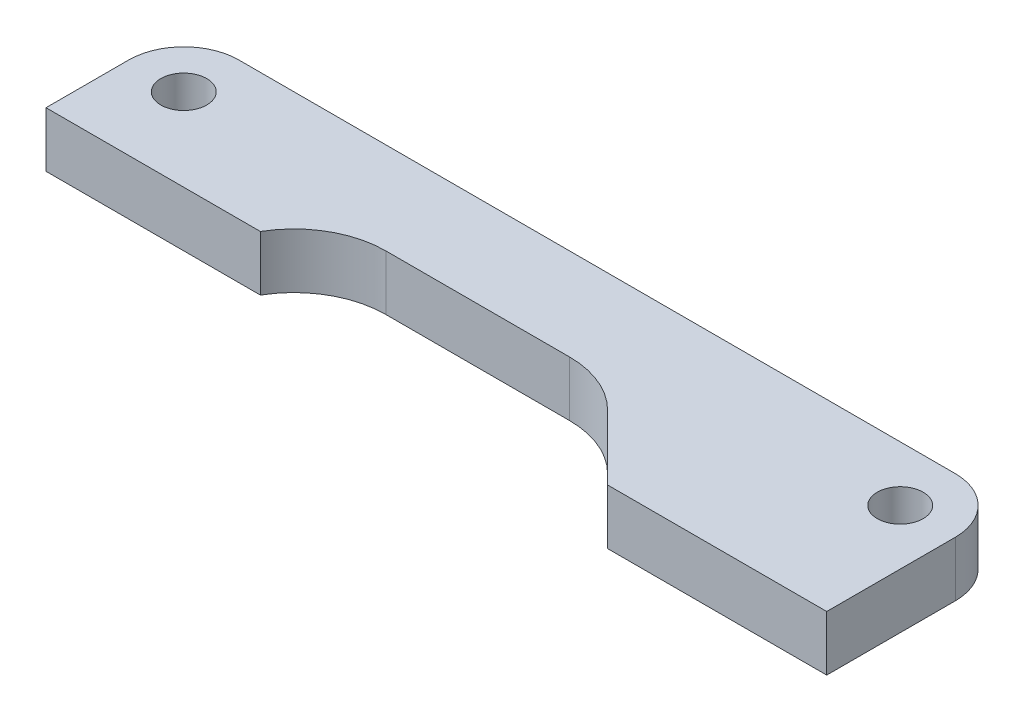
ISO-10303-21;
HEADER;
FILE_DESCRIPTION(('STEP AP214'),'2;1');
FILE_NAME('part.step','',(''),(''),'','','');
FILE_SCHEMA(('AUTOMOTIVE_DESIGN { 1 0 10303 214 1 1 1 1 }'));
ENDSEC;
DATA;
#1=APPLICATION_CONTEXT('core data for automotive mechanical design processes');
#2=APPLICATION_PROTOCOL_DEFINITION('international standard','automotive_design',2000,#1);
#3=PRODUCT_CONTEXT('',#1,'mechanical');
#4=PRODUCT('Part','Part','',(#3));
#5=PRODUCT_RELATED_PRODUCT_CATEGORY('part','',(#4));
#6=PRODUCT_DEFINITION_FORMATION('','',#4);
#7=PRODUCT_DEFINITION_CONTEXT('part definition',#1,'design');
#8=PRODUCT_DEFINITION('design','',#6,#7);
#9=PRODUCT_DEFINITION_SHAPE('','',#8);
#10=(LENGTH_UNIT() NAMED_UNIT(*) SI_UNIT(.MILLI.,.METRE.));
#11=(NAMED_UNIT(*) PLANE_ANGLE_UNIT() SI_UNIT($,.RADIAN.));
#12=(NAMED_UNIT(*) SI_UNIT($,.STERADIAN.) SOLID_ANGLE_UNIT());
#13=UNCERTAINTY_MEASURE_WITH_UNIT(LENGTH_MEASURE(1.E-05),#10,'distance_accuracy_value','');
#14=(GEOMETRIC_REPRESENTATION_CONTEXT(3) GLOBAL_UNCERTAINTY_ASSIGNED_CONTEXT((#13)) GLOBAL_UNIT_ASSIGNED_CONTEXT((#10,
#11,#12)) REPRESENTATION_CONTEXT('',''));
#15=CARTESIAN_POINT('',(0.,0.,0.));
#16=DIRECTION('',(0.,0.,1.));
#17=DIRECTION('',(1.,0.,0.));
#18=AXIS2_PLACEMENT_3D('',#15,#16,#17);
#19=CARTESIAN_POINT('',(6.,6.,-14.));
#20=DIRECTION('',(0.,-1.,0.));
#21=DIRECTION('',(0.,0.,-1.));
#22=AXIS2_PLACEMENT_3D('',#19,#20,#21);
#23=PLANE('',#22);
#24=CARTESIAN_POINT('',(6.,6.,-14.));
#25=DIRECTION('',(0.,1.,0.));
#26=DIRECTION('',(0.,0.,1.));
#27=AXIS2_PLACEMENT_3D('',#24,#25,#26);
#28=CIRCLE('',#27,2.5);
#29=CARTESIAN_POINT('',(6.,6.,-11.5));
#30=VERTEX_POINT('',#29);
#31=EDGE_CURVE('E132',#30,#30,#28,.T.);
#32=ORIENTED_EDGE('',*,*,#31,.F.);
#33=EDGE_LOOP('',(#32));
#34=FACE_BOUND('',#33,.T.);
#35=CARTESIAN_POINT('',(6.,6.,-14.));
#36=DIRECTION('',(0.,1.,0.));
#37=DIRECTION('',(0.,0.,-1.));
#38=AXIS2_PLACEMENT_3D('',#35,#36,#37);
#39=CIRCLE('',#38,6.);
#40=CARTESIAN_POINT('',(6.00000000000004,6.,-20.));
#41=VERTEX_POINT('',#40);
#42=CARTESIAN_POINT('',(0.,6.,-14.));
#43=VERTEX_POINT('',#42);
#44=EDGE_CURVE('E156',#41,#43,#39,.T.);
#45=ORIENTED_EDGE('',*,*,#44,.T.);
#46=DIRECTION('',(0.,0.,1.));
#47=VECTOR('',#46,1.);
#48=CARTESIAN_POINT('',(0.,6.,-5.));
#49=LINE('',#48,#47);
#50=CARTESIAN_POINT('',(0.,6.,-5.));
#51=VERTEX_POINT('',#50);
#52=EDGE_CURVE('E127',#43,#51,#49,.T.);
#53=ORIENTED_EDGE('',*,*,#52,.T.);
#54=DIRECTION('',(1.,0.,0.));
#55=VECTOR('',#54,1.);
#56=CARTESIAN_POINT('',(0.,6.,-5.));
#57=LINE('',#56,#55);
#58=CARTESIAN_POINT('',(23.3397459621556,6.,-5.));
#59=VERTEX_POINT('',#58);
#60=EDGE_CURVE('E159',#51,#59,#57,.T.);
#61=ORIENTED_EDGE('',*,*,#60,.T.);
#62=CARTESIAN_POINT('',(32.,6.,0.));
#63=DIRECTION('',(0.,-1.,0.));
#64=DIRECTION('',(0.,0.,1.));
#65=AXIS2_PLACEMENT_3D('',#62,#63,#64);
#66=CIRCLE('',#65,10.);
#67=CARTESIAN_POINT('',(32.,6.,-10.));
#68=VERTEX_POINT('',#67);
#69=EDGE_CURVE('E161',#59,#68,#66,.T.);
#70=ORIENTED_EDGE('',*,*,#69,.T.);
#71=DIRECTION('',(1.,0.,0.));
#72=VECTOR('',#71,1.);
#73=CARTESIAN_POINT('',(32.,6.,-10.));
#74=LINE('',#73,#72);
#75=CARTESIAN_POINT('',(52.,6.,-10.));
#76=VERTEX_POINT('',#75);
#77=EDGE_CURVE('E163',#68,#76,#74,.T.);
#78=ORIENTED_EDGE('',*,*,#77,.T.);
#79=CARTESIAN_POINT('',(52.,6.,0.));
#80=DIRECTION('',(0.,-1.,0.));
#81=DIRECTION('',(0.,0.,1.));
#82=AXIS2_PLACEMENT_3D('',#79,#80,#81);
#83=CIRCLE('',#82,10.);
#84=CARTESIAN_POINT('',(59.0710678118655,6.,-7.07106781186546));
#85=VERTEX_POINT('',#84);
#86=EDGE_CURVE('E165',#76,#85,#83,.T.);
#87=ORIENTED_EDGE('',*,*,#86,.T.);
#88=DIRECTION('',(0.707106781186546,0.,0.707106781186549));
#89=VECTOR('',#88,1.);
#90=CARTESIAN_POINT('',(59.0710678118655,6.,-7.07106781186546));
#91=LINE('',#90,#89);
#92=CARTESIAN_POINT('',(66.1421356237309,6.,0.));
#93=VERTEX_POINT('',#92);
#94=EDGE_CURVE('E167',#85,#93,#91,.T.);
#95=ORIENTED_EDGE('',*,*,#94,.T.);
#96=DIRECTION('',(1.,0.,0.));
#97=VECTOR('',#96,1.);
#98=CARTESIAN_POINT('',(66.1421356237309,6.,0.));
#99=LINE('',#98,#97);
#100=CARTESIAN_POINT('',(90.,6.,0.));
#101=VERTEX_POINT('',#100);
#102=EDGE_CURVE('E169',#93,#101,#99,.T.);
#103=ORIENTED_EDGE('',*,*,#102,.T.);
#104=DIRECTION('',(0.,0.,-1.));
#105=VECTOR('',#104,1.);
#106=CARTESIAN_POINT('',(90.,6.,0.));
#107=LINE('',#106,#105);
#108=CARTESIAN_POINT('',(90.,6.,-14.));
#109=VERTEX_POINT('',#108);
#110=EDGE_CURVE('E171',#101,#109,#107,.T.);
#111=ORIENTED_EDGE('',*,*,#110,.T.);
#112=CARTESIAN_POINT('',(84.,6.,-14.));
#113=DIRECTION('',(0.,1.,0.));
#114=DIRECTION('',(0.,0.,1.));
#115=AXIS2_PLACEMENT_3D('',#112,#113,#114);
#116=CIRCLE('',#115,6.);
#117=CARTESIAN_POINT('',(83.9999999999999,6.,-20.));
#118=VERTEX_POINT('',#117);
#119=EDGE_CURVE('E50',#109,#118,#116,.T.);
#120=ORIENTED_EDGE('',*,*,#119,.T.);
#121=DIRECTION('',(-1.,0.,0.));
#122=VECTOR('',#121,1.);
#123=CARTESIAN_POINT('',(6.00000000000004,6.,-20.));
#124=LINE('',#123,#122);
#125=EDGE_CURVE('E45',#118,#41,#124,.T.);
#126=ORIENTED_EDGE('',*,*,#125,.T.);
#127=EDGE_LOOP('',(#45,#53,#61,#70,#78,#87,#95,#103,#111,#120,#126));
#128=FACE_BOUND('',#127,.T.);
#129=CARTESIAN_POINT('',(84.,6.,-14.));
#130=DIRECTION('',(0.,1.,0.));
#131=DIRECTION('',(0.,0.,1.));
#132=AXIS2_PLACEMENT_3D('',#129,#130,#131);
#133=CIRCLE('',#132,2.5);
#134=CARTESIAN_POINT('',(84.,6.,-11.5));
#135=VERTEX_POINT('',#134);
#136=EDGE_CURVE('E266',#135,#135,#133,.T.);
#137=ORIENTED_EDGE('',*,*,#136,.F.);
#138=EDGE_LOOP('',(#137));
#139=FACE_BOUND('',#138,.T.);
#140=ADVANCED_FACE('F30',(#34,#128,#139),#23,.F.);
#141=CARTESIAN_POINT('',(6.,0.,-14.));
#142=DIRECTION('',(0.,-1.,0.));
#143=DIRECTION('',(0.,0.,-1.));
#144=AXIS2_PLACEMENT_3D('',#141,#142,#143);
#145=PLANE('',#144);
#146=CARTESIAN_POINT('',(6.,0.,-14.));
#147=DIRECTION('',(0.,1.,0.));
#148=DIRECTION('',(0.,0.,1.));
#149=AXIS2_PLACEMENT_3D('',#146,#147,#148);
#150=CIRCLE('',#149,2.5);
#151=CARTESIAN_POINT('',(6.,0.,-11.5));
#152=VERTEX_POINT('',#151);
#153=EDGE_CURVE('E135',#152,#152,#150,.T.);
#154=ORIENTED_EDGE('',*,*,#153,.T.);
#155=EDGE_LOOP('',(#154));
#156=FACE_BOUND('',#155,.T.);
#157=CARTESIAN_POINT('',(6.,0.,-14.));
#158=DIRECTION('',(0.,1.,0.));
#159=DIRECTION('',(0.,0.,-1.));
#160=AXIS2_PLACEMENT_3D('',#157,#158,#159);
#161=CIRCLE('',#160,6.);
#162=CARTESIAN_POINT('',(6.00000000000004,0.,-20.));
#163=VERTEX_POINT('',#162);
#164=CARTESIAN_POINT('',(0.,0.,-14.));
#165=VERTEX_POINT('',#164);
#166=EDGE_CURVE('E118',#163,#165,#161,.T.);
#167=ORIENTED_EDGE('',*,*,#166,.F.);
#168=DIRECTION('',(-1.,0.,0.));
#169=VECTOR('',#168,1.);
#170=CARTESIAN_POINT('',(6.00000000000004,0.,-20.));
#171=LINE('',#170,#169);
#172=CARTESIAN_POINT('',(83.9999999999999,0.,-20.));
#173=VERTEX_POINT('',#172);
#174=EDGE_CURVE('E154',#173,#163,#171,.T.);
#175=ORIENTED_EDGE('',*,*,#174,.F.);
#176=CARTESIAN_POINT('',(84.,0.,-14.));
#177=DIRECTION('',(0.,1.,0.));
#178=DIRECTION('',(0.,0.,1.));
#179=AXIS2_PLACEMENT_3D('',#176,#177,#178);
#180=CIRCLE('',#179,6.);
#181=CARTESIAN_POINT('',(90.,0.,-14.));
#182=VERTEX_POINT('',#181);
#183=EDGE_CURVE('E152',#182,#173,#180,.T.);
#184=ORIENTED_EDGE('',*,*,#183,.F.);
#185=DIRECTION('',(0.,0.,-1.));
#186=VECTOR('',#185,1.);
#187=CARTESIAN_POINT('',(90.,0.,0.));
#188=LINE('',#187,#186);
#189=CARTESIAN_POINT('',(90.,0.,0.));
#190=VERTEX_POINT('',#189);
#191=EDGE_CURVE('E150',#190,#182,#188,.T.);
#192=ORIENTED_EDGE('',*,*,#191,.F.);
#193=DIRECTION('',(1.,0.,0.));
#194=VECTOR('',#193,1.);
#195=CARTESIAN_POINT('',(66.1421356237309,0.,0.));
#196=LINE('',#195,#194);
#197=CARTESIAN_POINT('',(66.1421356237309,0.,0.));
#198=VERTEX_POINT('',#197);
#199=EDGE_CURVE('E148',#198,#190,#196,.T.);
#200=ORIENTED_EDGE('',*,*,#199,.F.);
#201=DIRECTION('',(0.707106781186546,0.,0.707106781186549));
#202=VECTOR('',#201,1.);
#203=CARTESIAN_POINT('',(59.0710678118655,0.,-7.07106781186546));
#204=LINE('',#203,#202);
#205=CARTESIAN_POINT('',(59.0710678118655,0.,-7.07106781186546));
#206=VERTEX_POINT('',#205);
#207=EDGE_CURVE('E146',#206,#198,#204,.T.);
#208=ORIENTED_EDGE('',*,*,#207,.F.);
#209=CARTESIAN_POINT('',(52.,0.,0.));
#210=DIRECTION('',(0.,-1.,0.));
#211=DIRECTION('',(0.,0.,1.));
#212=AXIS2_PLACEMENT_3D('',#209,#210,#211);
#213=CIRCLE('',#212,10.);
#214=CARTESIAN_POINT('',(52.,0.,-10.));
#215=VERTEX_POINT('',#214);
#216=EDGE_CURVE('E144',#215,#206,#213,.T.);
#217=ORIENTED_EDGE('',*,*,#216,.F.);
#218=DIRECTION('',(1.,0.,0.));
#219=VECTOR('',#218,1.);
#220=CARTESIAN_POINT('',(32.,0.,-10.));
#221=LINE('',#220,#219);
#222=CARTESIAN_POINT('',(32.,0.,-10.));
#223=VERTEX_POINT('',#222);
#224=EDGE_CURVE('E142',#223,#215,#221,.T.);
#225=ORIENTED_EDGE('',*,*,#224,.F.);
#226=CARTESIAN_POINT('',(32.,0.,0.));
#227=DIRECTION('',(0.,-1.,0.));
#228=DIRECTION('',(0.,0.,1.));
#229=AXIS2_PLACEMENT_3D('',#226,#227,#228);
#230=CIRCLE('',#229,10.);
#231=CARTESIAN_POINT('',(23.3397459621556,0.,-5.));
#232=VERTEX_POINT('',#231);
#233=EDGE_CURVE('E140',#232,#223,#230,.T.);
#234=ORIENTED_EDGE('',*,*,#233,.F.);
#235=DIRECTION('',(1.,0.,0.));
#236=VECTOR('',#235,1.);
#237=CARTESIAN_POINT('',(0.,0.,-5.));
#238=LINE('',#237,#236);
#239=CARTESIAN_POINT('',(0.,0.,-5.));
#240=VERTEX_POINT('',#239);
#241=EDGE_CURVE('E120',#240,#232,#238,.T.);
#242=ORIENTED_EDGE('',*,*,#241,.F.);
#243=DIRECTION('',(0.,0.,1.));
#244=VECTOR('',#243,1.);
#245=CARTESIAN_POINT('',(0.,0.,-5.));
#246=LINE('',#245,#244);
#247=EDGE_CURVE('E113',#165,#240,#246,.T.);
#248=ORIENTED_EDGE('',*,*,#247,.F.);
#249=EDGE_LOOP('',(#167,#175,#184,#192,#200,#208,#217,#225,#234,#242,#248));
#250=FACE_BOUND('',#249,.T.);
#251=CARTESIAN_POINT('',(84.,0.,-14.));
#252=DIRECTION('',(0.,1.,0.));
#253=DIRECTION('',(0.,0.,1.));
#254=AXIS2_PLACEMENT_3D('',#251,#252,#253);
#255=CIRCLE('',#254,2.5);
#256=CARTESIAN_POINT('',(84.,0.,-11.5));
#257=VERTEX_POINT('',#256);
#258=EDGE_CURVE('E269',#257,#257,#255,.T.);
#259=ORIENTED_EDGE('',*,*,#258,.T.);
#260=EDGE_LOOP('',(#259));
#261=FACE_BOUND('',#260,.T.);
#262=ADVANCED_FACE('F114',(#156,#250,#261),#145,.T.);
#263=CARTESIAN_POINT('',(6.,6.,-14.));
#264=DIRECTION('',(0.,-1.,0.));
#265=DIRECTION('',(0.,0.,-1.));
#266=AXIS2_PLACEMENT_3D('',#263,#264,#265);
#267=CYLINDRICAL_SURFACE('',#266,6.);
#268=ORIENTED_EDGE('',*,*,#166,.T.);
#269=DIRECTION('',(0.,-1.,0.));
#270=VECTOR('',#269,1.);
#271=CARTESIAN_POINT('',(0.,6.,-14.));
#272=LINE('',#271,#270);
#273=EDGE_CURVE('E11',#43,#165,#272,.T.);
#274=ORIENTED_EDGE('',*,*,#273,.F.);
#275=ORIENTED_EDGE('',*,*,#44,.F.);
#276=DIRECTION('',(0.,-1.,0.));
#277=VECTOR('',#276,1.);
#278=CARTESIAN_POINT('',(6.00000000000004,6.,-20.));
#279=LINE('',#278,#277);
#280=EDGE_CURVE('E131',#41,#163,#279,.T.);
#281=ORIENTED_EDGE('',*,*,#280,.T.);
#282=EDGE_LOOP('',(#268,#274,#275,#281));
#283=FACE_BOUND('',#282,.T.);
#284=ADVANCED_FACE('F32',(#283),#267,.T.);
#285=CARTESIAN_POINT('',(0.,6.,-5.));
#286=DIRECTION('',(1.,0.,0.));
#287=DIRECTION('',(0.,0.,-1.));
#288=AXIS2_PLACEMENT_3D('',#285,#286,#287);
#289=PLANE('',#288);
#290=ORIENTED_EDGE('',*,*,#247,.T.);
#291=DIRECTION('',(0.,-1.,0.));
#292=VECTOR('',#291,1.);
#293=CARTESIAN_POINT('',(0.,6.,-5.));
#294=LINE('',#293,#292);
#295=EDGE_CURVE('E38',#51,#240,#294,.T.);
#296=ORIENTED_EDGE('',*,*,#295,.F.);
#297=ORIENTED_EDGE('',*,*,#52,.F.);
#298=ORIENTED_EDGE('',*,*,#273,.T.);
#299=EDGE_LOOP('',(#290,#296,#297,#298));
#300=FACE_BOUND('',#299,.T.);
#301=ADVANCED_FACE('F126',(#300),#289,.F.);
#302=CARTESIAN_POINT('',(0.,6.,-5.));
#303=DIRECTION('',(0.,0.,-1.));
#304=DIRECTION('',(-1.,0.,0.));
#305=AXIS2_PLACEMENT_3D('',#302,#303,#304);
#306=PLANE('',#305);
#307=ORIENTED_EDGE('',*,*,#241,.T.);
#308=DIRECTION('',(0.,-1.,0.));
#309=VECTOR('',#308,1.);
#310=CARTESIAN_POINT('',(23.3397459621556,6.,-5.));
#311=LINE('',#310,#309);
#312=EDGE_CURVE('E197',#59,#232,#311,.T.);
#313=ORIENTED_EDGE('',*,*,#312,.F.);
#314=ORIENTED_EDGE('',*,*,#60,.F.);
#315=ORIENTED_EDGE('',*,*,#295,.T.);
#316=EDGE_LOOP('',(#307,#313,#314,#315));
#317=FACE_BOUND('',#316,.T.);
#318=ADVANCED_FACE('F201',(#317),#306,.F.);
#319=CARTESIAN_POINT('',(32.,6.,0.));
#320=DIRECTION('',(0.,-1.,0.));
#321=DIRECTION('',(0.,0.,-1.));
#322=AXIS2_PLACEMENT_3D('',#319,#320,#321);
#323=CYLINDRICAL_SURFACE('',#322,10.);
#324=ORIENTED_EDGE('',*,*,#233,.T.);
#325=DIRECTION('',(0.,-1.,0.));
#326=VECTOR('',#325,1.);
#327=CARTESIAN_POINT('',(32.,6.,-10.));
#328=LINE('',#327,#326);
#329=EDGE_CURVE('E194',#68,#223,#328,.T.);
#330=ORIENTED_EDGE('',*,*,#329,.F.);
#331=ORIENTED_EDGE('',*,*,#69,.F.);
#332=ORIENTED_EDGE('',*,*,#312,.T.);
#333=EDGE_LOOP('',(#324,#330,#331,#332));
#334=FACE_BOUND('',#333,.T.);
#335=ADVANCED_FACE('F209',(#334),#323,.F.);
#336=CARTESIAN_POINT('',(32.,6.,-10.));
#337=DIRECTION('',(0.,0.,-1.));
#338=DIRECTION('',(-1.,0.,0.));
#339=AXIS2_PLACEMENT_3D('',#336,#337,#338);
#340=PLANE('',#339);
#341=ORIENTED_EDGE('',*,*,#224,.T.);
#342=DIRECTION('',(0.,-1.,0.));
#343=VECTOR('',#342,1.);
#344=CARTESIAN_POINT('',(52.,6.,-10.));
#345=LINE('',#344,#343);
#346=EDGE_CURVE('E191',#76,#215,#345,.T.);
#347=ORIENTED_EDGE('',*,*,#346,.F.);
#348=ORIENTED_EDGE('',*,*,#77,.F.);
#349=ORIENTED_EDGE('',*,*,#329,.T.);
#350=EDGE_LOOP('',(#341,#347,#348,#349));
#351=FACE_BOUND('',#350,.T.);
#352=ADVANCED_FACE('F212',(#351),#340,.F.);
#353=CARTESIAN_POINT('',(52.,6.,0.));
#354=DIRECTION('',(0.,-1.,0.));
#355=DIRECTION('',(0.,0.,-1.));
#356=AXIS2_PLACEMENT_3D('',#353,#354,#355);
#357=CYLINDRICAL_SURFACE('',#356,10.);
#358=ORIENTED_EDGE('',*,*,#216,.T.);
#359=DIRECTION('',(0.,-1.,0.));
#360=VECTOR('',#359,1.);
#361=CARTESIAN_POINT('',(59.0710678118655,6.,-7.07106781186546));
#362=LINE('',#361,#360);
#363=EDGE_CURVE('E188',#85,#206,#362,.T.);
#364=ORIENTED_EDGE('',*,*,#363,.F.);
#365=ORIENTED_EDGE('',*,*,#86,.F.);
#366=ORIENTED_EDGE('',*,*,#346,.T.);
#367=EDGE_LOOP('',(#358,#364,#365,#366));
#368=FACE_BOUND('',#367,.T.);
#369=ADVANCED_FACE('F217',(#368),#357,.F.);
#370=CARTESIAN_POINT('',(59.0710678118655,6.,-7.07106781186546));
#371=DIRECTION('',(0.707106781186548,0.,-0.707106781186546));
#372=DIRECTION('',(-0.707106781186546,0.,-0.707106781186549));
#373=AXIS2_PLACEMENT_3D('',#370,#371,#372);
#374=PLANE('',#373);
#375=ORIENTED_EDGE('',*,*,#207,.T.);
#376=DIRECTION('',(0.,-1.,0.));
#377=VECTOR('',#376,1.);
#378=CARTESIAN_POINT('',(66.1421356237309,6.,0.));
#379=LINE('',#378,#377);
#380=EDGE_CURVE('E185',#93,#198,#379,.T.);
#381=ORIENTED_EDGE('',*,*,#380,.F.);
#382=ORIENTED_EDGE('',*,*,#94,.F.);
#383=ORIENTED_EDGE('',*,*,#363,.T.);
#384=EDGE_LOOP('',(#375,#381,#382,#383));
#385=FACE_BOUND('',#384,.T.);
#386=ADVANCED_FACE('F223',(#385),#374,.F.);
#387=CARTESIAN_POINT('',(66.1421356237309,6.,0.));
#388=DIRECTION('',(0.,0.,-1.));
#389=DIRECTION('',(-1.,0.,0.));
#390=AXIS2_PLACEMENT_3D('',#387,#388,#389);
#391=PLANE('',#390);
#392=ORIENTED_EDGE('',*,*,#199,.T.);
#393=DIRECTION('',(0.,-1.,0.));
#394=VECTOR('',#393,1.);
#395=CARTESIAN_POINT('',(90.,6.,0.));
#396=LINE('',#395,#394);
#397=EDGE_CURVE('E182',#101,#190,#396,.T.);
#398=ORIENTED_EDGE('',*,*,#397,.F.);
#399=ORIENTED_EDGE('',*,*,#102,.F.);
#400=ORIENTED_EDGE('',*,*,#380,.T.);
#401=EDGE_LOOP('',(#392,#398,#399,#400));
#402=FACE_BOUND('',#401,.T.);
#403=ADVANCED_FACE('F227',(#402),#391,.F.);
#404=CARTESIAN_POINT('',(90.,6.,0.));
#405=DIRECTION('',(-1.,0.,0.));
#406=DIRECTION('',(0.,0.,1.));
#407=AXIS2_PLACEMENT_3D('',#404,#405,#406);
#408=PLANE('',#407);
#409=ORIENTED_EDGE('',*,*,#191,.T.);
#410=DIRECTION('',(0.,-1.,0.));
#411=VECTOR('',#410,1.);
#412=CARTESIAN_POINT('',(90.,6.,-14.));
#413=LINE('',#412,#411);
#414=EDGE_CURVE('E179',#109,#182,#413,.T.);
#415=ORIENTED_EDGE('',*,*,#414,.F.);
#416=ORIENTED_EDGE('',*,*,#110,.F.);
#417=ORIENTED_EDGE('',*,*,#397,.T.);
#418=EDGE_LOOP('',(#409,#415,#416,#417));
#419=FACE_BOUND('',#418,.T.);
#420=ADVANCED_FACE('F232',(#419),#408,.F.);
#421=CARTESIAN_POINT('',(84.,6.,-14.));
#422=DIRECTION('',(0.,-1.,0.));
#423=DIRECTION('',(0.,0.,-1.));
#424=AXIS2_PLACEMENT_3D('',#421,#422,#423);
#425=CYLINDRICAL_SURFACE('',#424,6.);
#426=ORIENTED_EDGE('',*,*,#183,.T.);
#427=DIRECTION('',(0.,-1.,0.));
#428=VECTOR('',#427,1.);
#429=CARTESIAN_POINT('',(83.9999999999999,6.,-20.));
#430=LINE('',#429,#428);
#431=EDGE_CURVE('E176',#118,#173,#430,.T.);
#432=ORIENTED_EDGE('',*,*,#431,.F.);
#433=ORIENTED_EDGE('',*,*,#119,.F.);
#434=ORIENTED_EDGE('',*,*,#414,.T.);
#435=EDGE_LOOP('',(#426,#432,#433,#434));
#436=FACE_BOUND('',#435,.T.);
#437=ADVANCED_FACE('F235',(#436),#425,.T.);
#438=CARTESIAN_POINT('',(6.00000000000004,6.,-20.));
#439=DIRECTION('',(0.,0.,1.));
#440=DIRECTION('',(1.,0.,0.));
#441=AXIS2_PLACEMENT_3D('',#438,#439,#440);
#442=PLANE('',#441);
#443=ORIENTED_EDGE('',*,*,#174,.T.);
#444=ORIENTED_EDGE('',*,*,#280,.F.);
#445=ORIENTED_EDGE('',*,*,#125,.F.);
#446=ORIENTED_EDGE('',*,*,#431,.T.);
#447=EDGE_LOOP('',(#443,#444,#445,#446));
#448=FACE_BOUND('',#447,.T.);
#449=ADVANCED_FACE('F237',(#448),#442,.F.);
#450=CARTESIAN_POINT('',(6.,6.,-14.));
#451=DIRECTION('',(0.,-1.,0.));
#452=DIRECTION('',(0.,0.,-1.));
#453=AXIS2_PLACEMENT_3D('',#450,#451,#452);
#454=CYLINDRICAL_SURFACE('',#453,2.5);
#455=ORIENTED_EDGE('',*,*,#31,.T.);
#456=EDGE_LOOP('',(#455));
#457=FACE_BOUND('',#456,.T.);
#458=ORIENTED_EDGE('',*,*,#153,.F.);
#459=EDGE_LOOP('',(#458));
#460=FACE_BOUND('',#459,.T.);
#461=ADVANCED_FACE('F239',(#457,#460),#454,.F.);
#462=CARTESIAN_POINT('',(84.,6.,-14.));
#463=DIRECTION('',(0.,-1.,0.));
#464=DIRECTION('',(0.,0.,-1.));
#465=AXIS2_PLACEMENT_3D('',#462,#463,#464);
#466=CYLINDRICAL_SURFACE('',#465,2.5);
#467=ORIENTED_EDGE('',*,*,#136,.T.);
#468=EDGE_LOOP('',(#467));
#469=FACE_BOUND('',#468,.T.);
#470=ORIENTED_EDGE('',*,*,#258,.F.);
#471=EDGE_LOOP('',(#470));
#472=FACE_BOUND('',#471,.T.);
#473=ADVANCED_FACE('F245',(#469,#472),#466,.F.);
#474=CLOSED_SHELL('',(#140,#262,#284,#301,#318,#335,#352,#369,#386,#403,#420,#437,#449,#461,#473));
#475=MANIFOLD_SOLID_BREP('B2',#474);
#476=ADVANCED_BREP_SHAPE_REPRESENTATION('',(#18,#475),#14);
#477=SHAPE_DEFINITION_REPRESENTATION(#9,#476);
ENDSEC;
END-ISO-10303-21;
